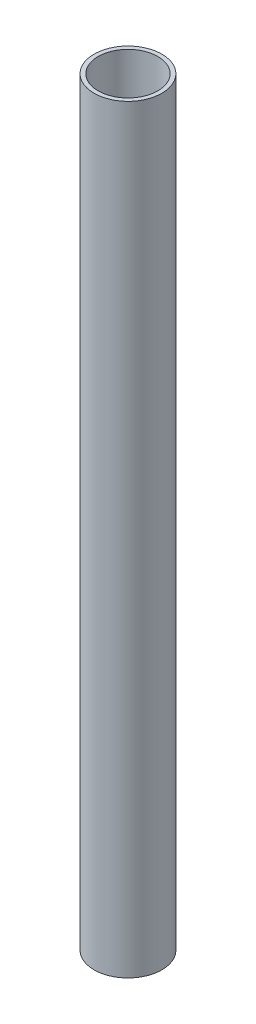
ISO-10303-21;
HEADER;
FILE_DESCRIPTION(('STEP AP214'),'2;1');
FILE_NAME('part.step','',(''),(''),'','','');
FILE_SCHEMA(('AUTOMOTIVE_DESIGN { 1 0 10303 214 1 1 1 1 }'));
ENDSEC;
DATA;
#1=APPLICATION_CONTEXT('core data for automotive mechanical design processes');
#2=APPLICATION_PROTOCOL_DEFINITION('international standard','automotive_design',2000,#1);
#3=PRODUCT_CONTEXT('',#1,'mechanical');
#4=PRODUCT('Part','Part','',(#3));
#5=PRODUCT_RELATED_PRODUCT_CATEGORY('part','',(#4));
#6=PRODUCT_DEFINITION_FORMATION('','',#4);
#7=PRODUCT_DEFINITION_CONTEXT('part definition',#1,'design');
#8=PRODUCT_DEFINITION('design','',#6,#7);
#9=PRODUCT_DEFINITION_SHAPE('','',#8);
#10=(LENGTH_UNIT() NAMED_UNIT(*) SI_UNIT(.MILLI.,.METRE.));
#11=(NAMED_UNIT(*) PLANE_ANGLE_UNIT() SI_UNIT($,.RADIAN.));
#12=(NAMED_UNIT(*) SI_UNIT($,.STERADIAN.) SOLID_ANGLE_UNIT());
#13=UNCERTAINTY_MEASURE_WITH_UNIT(LENGTH_MEASURE(1.E-05),#10,'distance_accuracy_value','');
#14=(GEOMETRIC_REPRESENTATION_CONTEXT(3) GLOBAL_UNCERTAINTY_ASSIGNED_CONTEXT((#13)) GLOBAL_UNIT_ASSIGNED_CONTEXT((#10,
#11,#12)) REPRESENTATION_CONTEXT('',''));
#15=CARTESIAN_POINT('',(0.,0.,0.));
#16=DIRECTION('',(0.,0.,1.));
#17=DIRECTION('',(1.,0.,0.));
#18=AXIS2_PLACEMENT_3D('',#15,#16,#17);
#19=CARTESIAN_POINT('',(0.,560.,0.));
#20=DIRECTION('',(0.,1.,0.));
#21=DIRECTION('',(0.,0.,1.));
#22=AXIS2_PLACEMENT_3D('',#19,#20,#21);
#23=PLANE('',#22);
#24=CARTESIAN_POINT('',(0.,560.,0.));
#25=DIRECTION('',(0.,1.,0.));
#26=DIRECTION('',(0.,0.,1.));
#27=AXIS2_PLACEMENT_3D('',#24,#25,#26);
#28=CIRCLE('',#27,25.);
#29=CARTESIAN_POINT('',(0.,560.,25.));
#30=VERTEX_POINT('',#29);
#31=EDGE_CURVE('E10',#30,#30,#28,.T.);
#32=ORIENTED_EDGE('',*,*,#31,.T.);
#33=EDGE_LOOP('',(#32));
#34=FACE_BOUND('',#33,.T.);
#35=CARTESIAN_POINT('',(0.,560.,0.));
#36=DIRECTION('',(0.,1.,0.));
#37=DIRECTION('',(0.,0.,1.));
#38=AXIS2_PLACEMENT_3D('',#35,#36,#37);
#39=CIRCLE('',#38,22.);
#40=CARTESIAN_POINT('',(0.,560.,22.));
#41=VERTEX_POINT('',#40);
#42=EDGE_CURVE('E43',#41,#41,#39,.T.);
#43=ORIENTED_EDGE('',*,*,#42,.F.);
#44=EDGE_LOOP('',(#43));
#45=FACE_BOUND('',#44,.T.);
#46=ADVANCED_FACE('F32',(#34,#45),#23,.T.);
#47=CARTESIAN_POINT('',(0.,0.,0.));
#48=DIRECTION('',(0.,1.,0.));
#49=DIRECTION('',(0.,0.,1.));
#50=AXIS2_PLACEMENT_3D('',#47,#48,#49);
#51=PLANE('',#50);
#52=CARTESIAN_POINT('',(0.,0.,0.));
#53=DIRECTION('',(0.,1.,0.));
#54=DIRECTION('',(0.,0.,1.));
#55=AXIS2_PLACEMENT_3D('',#52,#53,#54);
#56=CIRCLE('',#55,25.);
#57=CARTESIAN_POINT('',(0.,0.,25.));
#58=VERTEX_POINT('',#57);
#59=EDGE_CURVE('E36',#58,#58,#56,.T.);
#60=ORIENTED_EDGE('',*,*,#59,.F.);
#61=EDGE_LOOP('',(#60));
#62=FACE_BOUND('',#61,.T.);
#63=CARTESIAN_POINT('',(0.,0.,0.));
#64=DIRECTION('',(0.,1.,0.));
#65=DIRECTION('',(0.,0.,1.));
#66=AXIS2_PLACEMENT_3D('',#63,#64,#65);
#67=CIRCLE('',#66,22.);
#68=CARTESIAN_POINT('',(0.,0.,22.));
#69=VERTEX_POINT('',#68);
#70=EDGE_CURVE('E45',#69,#69,#67,.T.);
#71=ORIENTED_EDGE('',*,*,#70,.T.);
#72=EDGE_LOOP('',(#71));
#73=FACE_BOUND('',#72,.T.);
#74=ADVANCED_FACE('F55',(#62,#73),#51,.F.);
#75=CARTESIAN_POINT('',(0.,560.,0.));
#76=DIRECTION('',(0.,-1.,0.));
#77=DIRECTION('',(0.,0.,-1.));
#78=AXIS2_PLACEMENT_3D('',#75,#76,#77);
#79=CYLINDRICAL_SURFACE('',#78,25.);
#80=ORIENTED_EDGE('',*,*,#31,.F.);
#81=EDGE_LOOP('',(#80));
#82=FACE_BOUND('',#81,.T.);
#83=ORIENTED_EDGE('',*,*,#59,.T.);
#84=EDGE_LOOP('',(#83));
#85=FACE_BOUND('',#84,.T.);
#86=ADVANCED_FACE('F34',(#82,#85),#79,.T.);
#87=CARTESIAN_POINT('',(0.,560.,0.));
#88=DIRECTION('',(0.,-1.,0.));
#89=DIRECTION('',(0.,0.,-1.));
#90=AXIS2_PLACEMENT_3D('',#87,#88,#89);
#91=CYLINDRICAL_SURFACE('',#90,22.);
#92=ORIENTED_EDGE('',*,*,#42,.T.);
#93=EDGE_LOOP('',(#92));
#94=FACE_BOUND('',#93,.T.);
#95=ORIENTED_EDGE('',*,*,#70,.F.);
#96=EDGE_LOOP('',(#95));
#97=FACE_BOUND('',#96,.T.);
#98=ADVANCED_FACE('F51',(#94,#97),#91,.F.);
#99=CLOSED_SHELL('',(#46,#74,#86,#98));
#100=MANIFOLD_SOLID_BREP('B2',#99);
#101=ADVANCED_BREP_SHAPE_REPRESENTATION('',(#18,#100),#14);
#102=SHAPE_DEFINITION_REPRESENTATION(#9,#101);
ENDSEC;
END-ISO-10303-21;
